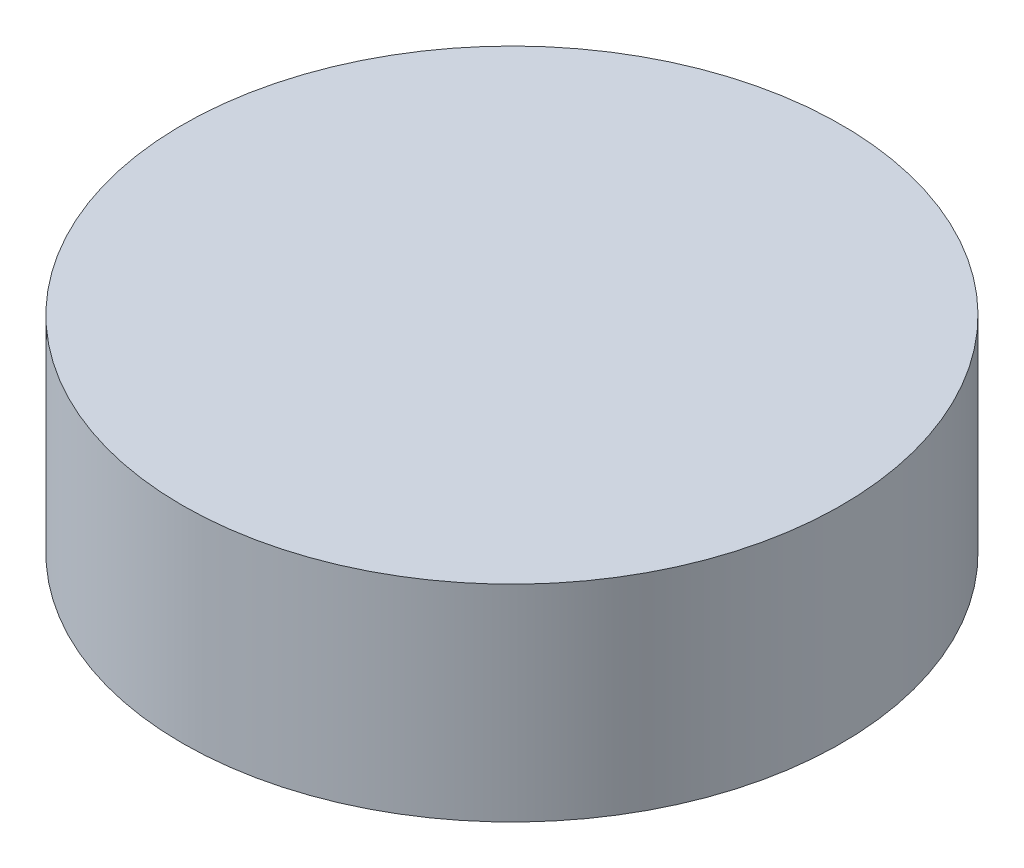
ISO-10303-21;
HEADER;
FILE_DESCRIPTION(('STEP AP214'),'2;1');
FILE_NAME('part.step','',(''),(''),'','','');
FILE_SCHEMA(('AUTOMOTIVE_DESIGN { 1 0 10303 214 1 1 1 1 }'));
ENDSEC;
DATA;
#1=APPLICATION_CONTEXT('core data for automotive mechanical design processes');
#2=APPLICATION_PROTOCOL_DEFINITION('international standard','automotive_design',2000,#1);
#3=PRODUCT_CONTEXT('',#1,'mechanical');
#4=PRODUCT('Part','Part','',(#3));
#5=PRODUCT_RELATED_PRODUCT_CATEGORY('part','',(#4));
#6=PRODUCT_DEFINITION_FORMATION('','',#4);
#7=PRODUCT_DEFINITION_CONTEXT('part definition',#1,'design');
#8=PRODUCT_DEFINITION('design','',#6,#7);
#9=PRODUCT_DEFINITION_SHAPE('','',#8);
#10=(LENGTH_UNIT() NAMED_UNIT(*) SI_UNIT(.MILLI.,.METRE.));
#11=(NAMED_UNIT(*) PLANE_ANGLE_UNIT() SI_UNIT($,.RADIAN.));
#12=(NAMED_UNIT(*) SI_UNIT($,.STERADIAN.) SOLID_ANGLE_UNIT());
#13=UNCERTAINTY_MEASURE_WITH_UNIT(LENGTH_MEASURE(1.E-05),#10,'distance_accuracy_value','');
#14=(GEOMETRIC_REPRESENTATION_CONTEXT(3) GLOBAL_UNCERTAINTY_ASSIGNED_CONTEXT((#13)) GLOBAL_UNIT_ASSIGNED_CONTEXT((#10,
#11,#12)) REPRESENTATION_CONTEXT('',''));
#15=CARTESIAN_POINT('',(0.,0.,0.));
#16=DIRECTION('',(0.,0.,1.));
#17=DIRECTION('',(1.,0.,0.));
#18=AXIS2_PLACEMENT_3D('',#15,#16,#17);
#19=CARTESIAN_POINT('',(0.,25.,0.));
#20=DIRECTION('',(0.,-1.,0.));
#21=DIRECTION('',(0.,0.,-1.));
#22=AXIS2_PLACEMENT_3D('',#19,#20,#21);
#23=CYLINDRICAL_SURFACE('',#22,40.);
#24=CARTESIAN_POINT('',(0.,25.,0.));
#25=DIRECTION('',(0.,1.,0.));
#26=DIRECTION('',(0.,0.,1.));
#27=AXIS2_PLACEMENT_3D('',#24,#25,#26);
#28=CIRCLE('',#27,40.);
#29=CARTESIAN_POINT('',(0.,25.,40.));
#30=VERTEX_POINT('',#29);
#31=EDGE_CURVE('E10',#30,#30,#28,.T.);
#32=ORIENTED_EDGE('',*,*,#31,.F.);
#33=EDGE_LOOP('',(#32));
#34=FACE_BOUND('',#33,.T.);
#35=CARTESIAN_POINT('',(0.,0.,0.));
#36=DIRECTION('',(0.,1.,0.));
#37=DIRECTION('',(0.,0.,1.));
#38=AXIS2_PLACEMENT_3D('',#35,#36,#37);
#39=CIRCLE('',#38,40.);
#40=CARTESIAN_POINT('',(0.,0.,40.));
#41=VERTEX_POINT('',#40);
#42=EDGE_CURVE('E34',#41,#41,#39,.T.);
#43=ORIENTED_EDGE('',*,*,#42,.T.);
#44=EDGE_LOOP('',(#43));
#45=FACE_BOUND('',#44,.T.);
#46=ADVANCED_FACE('F31',(#34,#45),#23,.T.);
#47=CARTESIAN_POINT('',(0.,25.,0.));
#48=DIRECTION('',(0.,1.,0.));
#49=DIRECTION('',(0.,0.,1.));
#50=AXIS2_PLACEMENT_3D('',#47,#48,#49);
#51=PLANE('',#50);
#52=ORIENTED_EDGE('',*,*,#31,.T.);
#53=EDGE_LOOP('',(#52));
#54=FACE_BOUND('',#53,.T.);
#55=ADVANCED_FACE('F46',(#54),#51,.T.);
#56=CARTESIAN_POINT('',(0.,0.,0.));
#57=DIRECTION('',(0.,1.,0.));
#58=DIRECTION('',(0.,0.,1.));
#59=AXIS2_PLACEMENT_3D('',#56,#57,#58);
#60=PLANE('',#59);
#61=ORIENTED_EDGE('',*,*,#42,.F.);
#62=EDGE_LOOP('',(#61));
#63=FACE_BOUND('',#62,.T.);
#64=ADVANCED_FACE('F44',(#63),#60,.F.);
#65=CLOSED_SHELL('',(#46,#55,#64));
#66=MANIFOLD_SOLID_BREP('B2',#65);
#67=ADVANCED_BREP_SHAPE_REPRESENTATION('',(#18,#66),#14);
#68=SHAPE_DEFINITION_REPRESENTATION(#9,#67);
ENDSEC;
END-ISO-10303-21;
